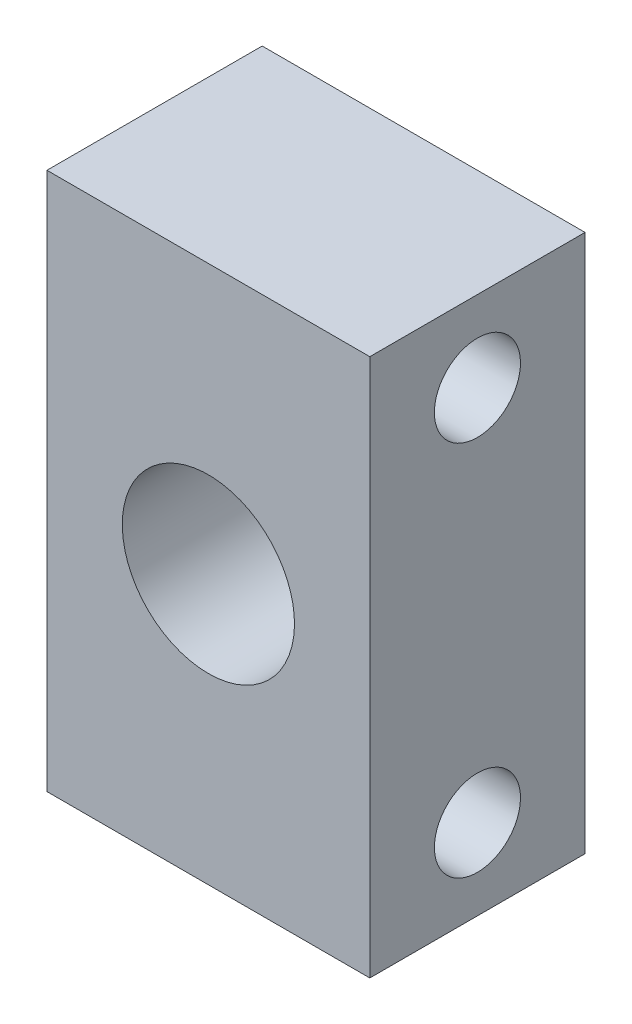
ISO-10303-21;
HEADER;
FILE_DESCRIPTION(('STEP AP214'),'2;1');
FILE_NAME('part.step','',(''),(''),'','','');
FILE_SCHEMA(('AUTOMOTIVE_DESIGN { 1 0 10303 214 1 1 1 1 }'));
ENDSEC;
DATA;
#1=APPLICATION_CONTEXT('core data for automotive mechanical design processes');
#2=APPLICATION_PROTOCOL_DEFINITION('international standard','automotive_design',2000,#1);
#3=PRODUCT_CONTEXT('',#1,'mechanical');
#4=PRODUCT('Part','Part','',(#3));
#5=PRODUCT_RELATED_PRODUCT_CATEGORY('part','',(#4));
#6=PRODUCT_DEFINITION_FORMATION('','',#4);
#7=PRODUCT_DEFINITION_CONTEXT('part definition',#1,'design');
#8=PRODUCT_DEFINITION('design','',#6,#7);
#9=PRODUCT_DEFINITION_SHAPE('','',#8);
#10=(LENGTH_UNIT() NAMED_UNIT(*) SI_UNIT(.MILLI.,.METRE.));
#11=(NAMED_UNIT(*) PLANE_ANGLE_UNIT() SI_UNIT($,.RADIAN.));
#12=(NAMED_UNIT(*) SI_UNIT($,.STERADIAN.) SOLID_ANGLE_UNIT());
#13=UNCERTAINTY_MEASURE_WITH_UNIT(LENGTH_MEASURE(1.E-05),#10,'distance_accuracy_value','');
#14=(GEOMETRIC_REPRESENTATION_CONTEXT(3) GLOBAL_UNCERTAINTY_ASSIGNED_CONTEXT((#13)) GLOBAL_UNIT_ASSIGNED_CONTEXT((#10,
#11,#12)) REPRESENTATION_CONTEXT('',''));
#15=CARTESIAN_POINT('',(0.,0.,0.));
#16=DIRECTION('',(0.,0.,1.));
#17=DIRECTION('',(1.,0.,0.));
#18=AXIS2_PLACEMENT_3D('',#15,#16,#17);
#19=CARTESIAN_POINT('',(-15.,25.,20.));
#20=DIRECTION('',(1.,0.,0.));
#21=DIRECTION('',(0.,1.,0.));
#22=AXIS2_PLACEMENT_3D('',#19,#20,#21);
#23=PLANE('',#22);
#24=CARTESIAN_POINT('',(-15.,17.5,10.));
#25=DIRECTION('',(1.,0.,0.));
#26=DIRECTION('',(0.,-1.,0.));
#27=AXIS2_PLACEMENT_3D('',#24,#25,#26);
#28=CIRCLE('',#27,4.);
#29=CARTESIAN_POINT('',(-15.,13.5,10.));
#30=VERTEX_POINT('',#29);
#31=EDGE_CURVE('E117',#30,#30,#28,.T.);
#32=ORIENTED_EDGE('',*,*,#31,.T.);
#33=EDGE_LOOP('',(#32));
#34=FACE_BOUND('',#33,.T.);
#35=CARTESIAN_POINT('',(-15.,-17.5,10.));
#36=DIRECTION('',(1.,0.,0.));
#37=DIRECTION('',(0.,1.,0.));
#38=AXIS2_PLACEMENT_3D('',#35,#36,#37);
#39=CIRCLE('',#38,4.);
#40=CARTESIAN_POINT('',(-15.,-13.5,10.));
#41=VERTEX_POINT('',#40);
#42=EDGE_CURVE('E120',#41,#41,#39,.T.);
#43=ORIENTED_EDGE('',*,*,#42,.T.);
#44=EDGE_LOOP('',(#43));
#45=FACE_BOUND('',#44,.T.);
#46=DIRECTION('',(0.,-1.,0.));
#47=VECTOR('',#46,1.);
#48=CARTESIAN_POINT('',(-15.,25.,0.));
#49=LINE('',#48,#47);
#50=CARTESIAN_POINT('',(-15.,25.,0.));
#51=VERTEX_POINT('',#50);
#52=CARTESIAN_POINT('',(-15.,-25.,0.));
#53=VERTEX_POINT('',#52);
#54=EDGE_CURVE('E58',#51,#53,#49,.T.);
#55=ORIENTED_EDGE('',*,*,#54,.T.);
#56=DIRECTION('',(0.,0.,-1.));
#57=VECTOR('',#56,1.);
#58=CARTESIAN_POINT('',(-15.,-25.,20.));
#59=LINE('',#58,#57);
#60=CARTESIAN_POINT('',(-15.,-25.,20.));
#61=VERTEX_POINT('',#60);
#62=EDGE_CURVE('E9',#61,#53,#59,.T.);
#63=ORIENTED_EDGE('',*,*,#62,.F.);
#64=DIRECTION('',(0.,-1.,0.));
#65=VECTOR('',#64,1.);
#66=CARTESIAN_POINT('',(-15.,25.,20.));
#67=LINE('',#66,#65);
#68=CARTESIAN_POINT('',(-15.,25.,20.));
#69=VERTEX_POINT('',#68);
#70=EDGE_CURVE('E81',#69,#61,#67,.T.);
#71=ORIENTED_EDGE('',*,*,#70,.F.);
#72=DIRECTION('',(0.,0.,-1.));
#73=VECTOR('',#72,1.);
#74=CARTESIAN_POINT('',(-15.,25.,20.));
#75=LINE('',#74,#73);
#76=EDGE_CURVE('E70',#69,#51,#75,.T.);
#77=ORIENTED_EDGE('',*,*,#76,.T.);
#78=EDGE_LOOP('',(#55,#63,#71,#77));
#79=FACE_BOUND('',#78,.T.);
#80=ADVANCED_FACE('F14',(#34,#45,#79),#23,.F.);
#81=CARTESIAN_POINT('',(-15.,-25.,20.));
#82=DIRECTION('',(0.,1.,0.));
#83=DIRECTION('',(-1.,0.,0.));
#84=AXIS2_PLACEMENT_3D('',#81,#82,#83);
#85=PLANE('',#84);
#86=DIRECTION('',(1.,0.,0.));
#87=VECTOR('',#86,1.);
#88=CARTESIAN_POINT('',(-15.,-25.,0.));
#89=LINE('',#88,#87);
#90=CARTESIAN_POINT('',(15.,-25.,0.));
#91=VERTEX_POINT('',#90);
#92=EDGE_CURVE('E54',#53,#91,#89,.T.);
#93=ORIENTED_EDGE('',*,*,#92,.T.);
#94=DIRECTION('',(0.,0.,-1.));
#95=VECTOR('',#94,1.);
#96=CARTESIAN_POINT('',(15.,-25.,20.));
#97=LINE('',#96,#95);
#98=CARTESIAN_POINT('',(15.,-25.,20.));
#99=VERTEX_POINT('',#98);
#100=EDGE_CURVE('E21',#99,#91,#97,.T.);
#101=ORIENTED_EDGE('',*,*,#100,.F.);
#102=DIRECTION('',(1.,0.,0.));
#103=VECTOR('',#102,1.);
#104=CARTESIAN_POINT('',(-15.,-25.,20.));
#105=LINE('',#104,#103);
#106=EDGE_CURVE('E66',#61,#99,#105,.T.);
#107=ORIENTED_EDGE('',*,*,#106,.F.);
#108=ORIENTED_EDGE('',*,*,#62,.T.);
#109=EDGE_LOOP('',(#93,#101,#107,#108));
#110=FACE_BOUND('',#109,.T.);
#111=ADVANCED_FACE('F65',(#110),#85,.F.);
#112=CARTESIAN_POINT('',(15.,25.,20.));
#113=DIRECTION('',(-1.,0.,0.));
#114=DIRECTION('',(0.,-1.,0.));
#115=AXIS2_PLACEMENT_3D('',#112,#113,#114);
#116=PLANE('',#115);
#117=CARTESIAN_POINT('',(15.,17.5,10.));
#118=DIRECTION('',(1.,0.,0.));
#119=DIRECTION('',(0.,-1.,0.));
#120=AXIS2_PLACEMENT_3D('',#117,#118,#119);
#121=CIRCLE('',#120,4.);
#122=CARTESIAN_POINT('',(15.,13.5,10.));
#123=VERTEX_POINT('',#122);
#124=EDGE_CURVE('E129',#123,#123,#121,.T.);
#125=ORIENTED_EDGE('',*,*,#124,.F.);
#126=EDGE_LOOP('',(#125));
#127=FACE_BOUND('',#126,.T.);
#128=CARTESIAN_POINT('',(15.,-17.5,10.));
#129=DIRECTION('',(1.,0.,0.));
#130=DIRECTION('',(0.,1.,0.));
#131=AXIS2_PLACEMENT_3D('',#128,#129,#130);
#132=CIRCLE('',#131,4.);
#133=CARTESIAN_POINT('',(15.,-13.5,10.));
#134=VERTEX_POINT('',#133);
#135=EDGE_CURVE('E122',#134,#134,#132,.T.);
#136=ORIENTED_EDGE('',*,*,#135,.F.);
#137=EDGE_LOOP('',(#136));
#138=FACE_BOUND('',#137,.T.);
#139=DIRECTION('',(0.,1.,0.));
#140=VECTOR('',#139,1.);
#141=CARTESIAN_POINT('',(15.,25.,0.));
#142=LINE('',#141,#140);
#143=CARTESIAN_POINT('',(15.,25.,0.));
#144=VERTEX_POINT('',#143);
#145=EDGE_CURVE('E59',#91,#144,#142,.T.);
#146=ORIENTED_EDGE('',*,*,#145,.T.);
#147=DIRECTION('',(0.,0.,-1.));
#148=VECTOR('',#147,1.);
#149=CARTESIAN_POINT('',(15.,25.,20.));
#150=LINE('',#149,#148);
#151=CARTESIAN_POINT('',(15.,25.,20.));
#152=VERTEX_POINT('',#151);
#153=EDGE_CURVE('E87',#152,#144,#150,.T.);
#154=ORIENTED_EDGE('',*,*,#153,.F.);
#155=DIRECTION('',(0.,1.,0.));
#156=VECTOR('',#155,1.);
#157=CARTESIAN_POINT('',(15.,25.,20.));
#158=LINE('',#157,#156);
#159=EDGE_CURVE('E33',#99,#152,#158,.T.);
#160=ORIENTED_EDGE('',*,*,#159,.F.);
#161=ORIENTED_EDGE('',*,*,#100,.T.);
#162=EDGE_LOOP('',(#146,#154,#160,#161));
#163=FACE_BOUND('',#162,.T.);
#164=ADVANCED_FACE('F90',(#127,#138,#163),#116,.F.);
#165=CARTESIAN_POINT('',(-15.,25.,20.));
#166=DIRECTION('',(0.,-1.,0.));
#167=DIRECTION('',(1.,0.,0.));
#168=AXIS2_PLACEMENT_3D('',#165,#166,#167);
#169=PLANE('',#168);
#170=DIRECTION('',(-1.,0.,0.));
#171=VECTOR('',#170,1.);
#172=CARTESIAN_POINT('',(-15.,25.,0.));
#173=LINE('',#172,#171);
#174=EDGE_CURVE('E79',#144,#51,#173,.T.);
#175=ORIENTED_EDGE('',*,*,#174,.T.);
#176=ORIENTED_EDGE('',*,*,#76,.F.);
#177=DIRECTION('',(-1.,0.,0.));
#178=VECTOR('',#177,1.);
#179=CARTESIAN_POINT('',(-15.,25.,20.));
#180=LINE('',#179,#178);
#181=EDGE_CURVE('E28',#152,#69,#180,.T.);
#182=ORIENTED_EDGE('',*,*,#181,.F.);
#183=ORIENTED_EDGE('',*,*,#153,.T.);
#184=EDGE_LOOP('',(#175,#176,#182,#183));
#185=FACE_BOUND('',#184,.T.);
#186=ADVANCED_FACE('F92',(#185),#169,.F.);
#187=CARTESIAN_POINT('',(-15.,-25.,20.));
#188=DIRECTION('',(0.,0.,1.));
#189=DIRECTION('',(0.,-1.,0.));
#190=AXIS2_PLACEMENT_3D('',#187,#188,#189);
#191=PLANE('',#190);
#192=CARTESIAN_POINT('',(0.,0.,20.));
#193=DIRECTION('',(0.,0.,1.));
#194=DIRECTION('',(0.,-1.,0.));
#195=AXIS2_PLACEMENT_3D('',#192,#193,#194);
#196=CIRCLE('',#195,8.);
#197=CARTESIAN_POINT('',(0.,-8.,20.));
#198=VERTEX_POINT('',#197);
#199=EDGE_CURVE('E74',#198,#198,#196,.T.);
#200=ORIENTED_EDGE('',*,*,#199,.F.);
#201=EDGE_LOOP('',(#200));
#202=FACE_BOUND('',#201,.T.);
#203=ORIENTED_EDGE('',*,*,#70,.T.);
#204=ORIENTED_EDGE('',*,*,#106,.T.);
#205=ORIENTED_EDGE('',*,*,#159,.T.);
#206=ORIENTED_EDGE('',*,*,#181,.T.);
#207=EDGE_LOOP('',(#203,#204,#205,#206));
#208=FACE_BOUND('',#207,.T.);
#209=ADVANCED_FACE('F93',(#202,#208),#191,.T.);
#210=CARTESIAN_POINT('',(-15.,-25.,0.));
#211=DIRECTION('',(0.,0.,1.));
#212=DIRECTION('',(0.,-1.,0.));
#213=AXIS2_PLACEMENT_3D('',#210,#211,#212);
#214=PLANE('',#213);
#215=CARTESIAN_POINT('',(0.,0.,0.));
#216=DIRECTION('',(0.,0.,1.));
#217=DIRECTION('',(0.,-1.,0.));
#218=AXIS2_PLACEMENT_3D('',#215,#216,#217);
#219=CIRCLE('',#218,8.);
#220=CARTESIAN_POINT('',(0.,-8.,0.));
#221=VERTEX_POINT('',#220);
#222=EDGE_CURVE('E71',#221,#221,#219,.T.);
#223=ORIENTED_EDGE('',*,*,#222,.T.);
#224=EDGE_LOOP('',(#223));
#225=FACE_BOUND('',#224,.T.);
#226=ORIENTED_EDGE('',*,*,#54,.F.);
#227=ORIENTED_EDGE('',*,*,#174,.F.);
#228=ORIENTED_EDGE('',*,*,#145,.F.);
#229=ORIENTED_EDGE('',*,*,#92,.F.);
#230=EDGE_LOOP('',(#226,#227,#228,#229));
#231=FACE_BOUND('',#230,.T.);
#232=ADVANCED_FACE('F55',(#225,#231),#214,.F.);
#233=CARTESIAN_POINT('',(0.,0.,0.));
#234=DIRECTION('',(0.,0.,1.));
#235=DIRECTION('',(0.,-1.,0.));
#236=AXIS2_PLACEMENT_3D('',#233,#234,#235);
#237=CYLINDRICAL_SURFACE('',#236,8.);
#238=ORIENTED_EDGE('',*,*,#222,.F.);
#239=EDGE_LOOP('',(#238));
#240=FACE_BOUND('',#239,.T.);
#241=ORIENTED_EDGE('',*,*,#199,.T.);
#242=EDGE_LOOP('',(#241));
#243=FACE_BOUND('',#242,.T.);
#244=ADVANCED_FACE('F103',(#240,#243),#237,.F.);
#245=CARTESIAN_POINT('',(-15.,-17.5,10.));
#246=DIRECTION('',(1.,0.,0.));
#247=DIRECTION('',(0.,1.,0.));
#248=AXIS2_PLACEMENT_3D('',#245,#246,#247);
#249=CYLINDRICAL_SURFACE('',#248,4.);
#250=ORIENTED_EDGE('',*,*,#42,.F.);
#251=EDGE_LOOP('',(#250));
#252=FACE_BOUND('',#251,.T.);
#253=ORIENTED_EDGE('',*,*,#135,.T.);
#254=EDGE_LOOP('',(#253));
#255=FACE_BOUND('',#254,.T.);
#256=ADVANCED_FACE('F140',(#252,#255),#249,.F.);
#257=CARTESIAN_POINT('',(-15.,17.5,10.));
#258=DIRECTION('',(1.,0.,0.));
#259=DIRECTION('',(0.,1.,0.));
#260=AXIS2_PLACEMENT_3D('',#257,#258,#259);
#261=CYLINDRICAL_SURFACE('',#260,4.);
#262=ORIENTED_EDGE('',*,*,#31,.F.);
#263=EDGE_LOOP('',(#262));
#264=FACE_BOUND('',#263,.T.);
#265=ORIENTED_EDGE('',*,*,#124,.T.);
#266=EDGE_LOOP('',(#265));
#267=FACE_BOUND('',#266,.T.);
#268=ADVANCED_FACE('F133',(#264,#267),#261,.F.);
#269=CLOSED_SHELL('',(#80,#111,#164,#186,#209,#232,#244,#256,#268));
#270=MANIFOLD_SOLID_BREP('B1',#269);
#271=ADVANCED_BREP_SHAPE_REPRESENTATION('',(#18,#270),#14);
#272=SHAPE_DEFINITION_REPRESENTATION(#9,#271);
ENDSEC;
END-ISO-10303-21;
